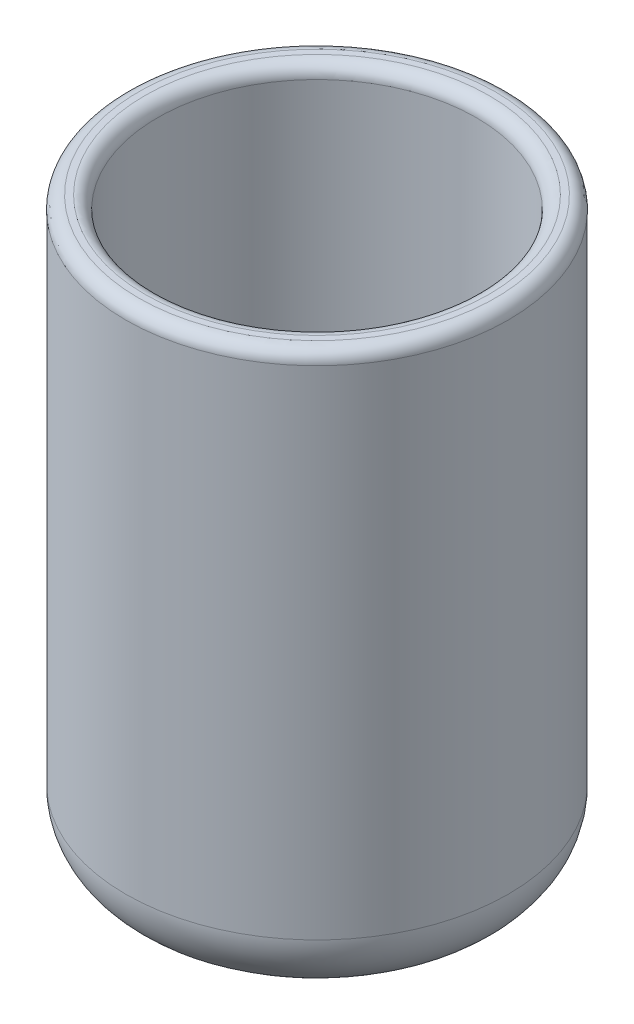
from build123d import *

# Parameters (mm, degrees)
CROQUIS2_R              = 38.1
SALIENTE_EXTRUIR1_DEPTH = 114.3
REDONDEO1_R             = 12.7
VACIADO1_T              = -6.35
REDONDEO2_R             = 2.54


with BuildPart() as part:
    # Croquis2 → Saliente-Extruir1 (new body)
    with BuildSketch(Plane(origin=(0, 0, 0), x_dir=(1, 0, 0), z_dir=(0, 1, 0))):
        with Locations(Location((0, 0, 0), (0, 0, 270))):
            Circle(CROQUIS2_R)
    extrude(amount=SALIENTE_EXTRUIR1_DEPTH)

    # Redondeo1
    redondeo1_edges = [part.edges().sort_by_distance(p)[0] for p in [
        (0, 0, -38.1),
    ]]
    fillet(redondeo1_edges, radius=REDONDEO1_R)

    # Vaciado1
    vaciado1_openings = [part.faces().sort_by_distance(p)[0] for p in [
        (0, 114.3, 0),
    ]]
    offset(amount=VACIADO1_T, openings=vaciado1_openings, kind=Kind.INTERSECTION)

    # Redondeo2
    redondeo2_edges = [part.edges().sort_by_distance(p)[0] for p in [
        (0, 114.3, -31.75),
        (0, 114.3, -38.1),
    ]]
    fillet(redondeo2_edges, radius=REDONDEO2_R)


solid = part.part
